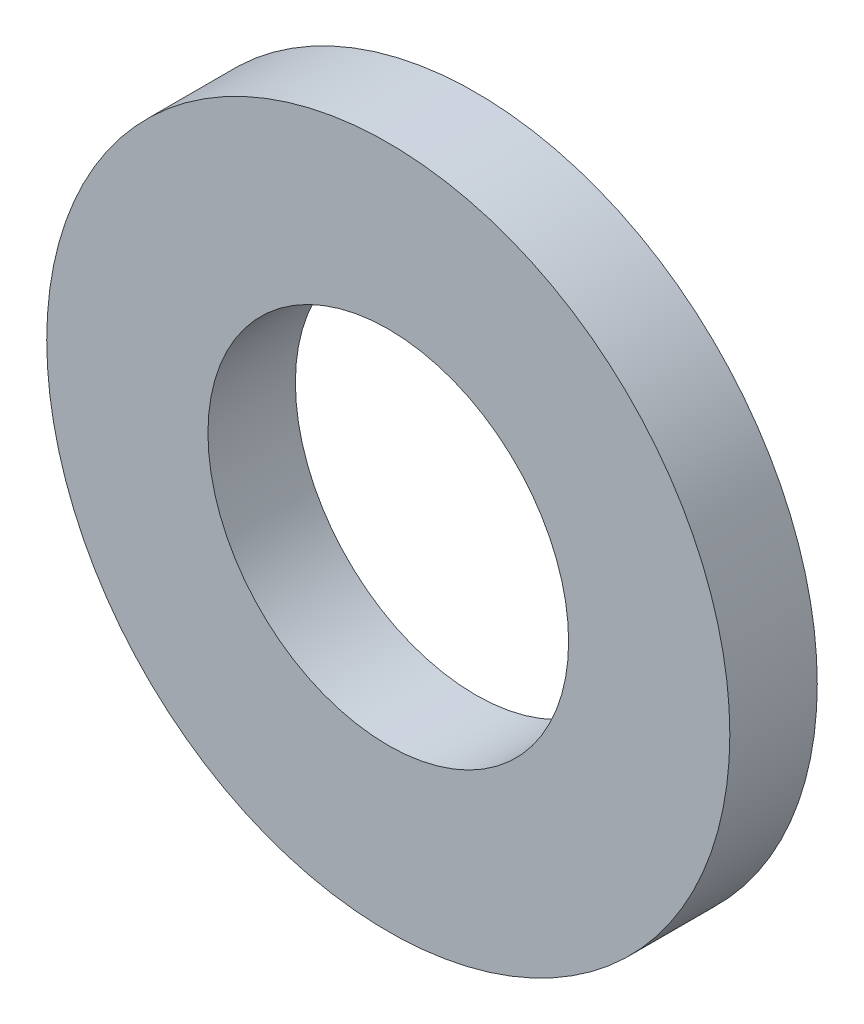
ISO-10303-21;
HEADER;
FILE_DESCRIPTION(('STEP AP214'),'2;1');
FILE_NAME('part.step','',(''),(''),'','','');
FILE_SCHEMA(('AUTOMOTIVE_DESIGN { 1 0 10303 214 1 1 1 1 }'));
ENDSEC;
DATA;
#1=APPLICATION_CONTEXT('core data for automotive mechanical design processes');
#2=APPLICATION_PROTOCOL_DEFINITION('international standard','automotive_design',2000,#1);
#3=PRODUCT_CONTEXT('',#1,'mechanical');
#4=PRODUCT('Part','Part','',(#3));
#5=PRODUCT_RELATED_PRODUCT_CATEGORY('part','',(#4));
#6=PRODUCT_DEFINITION_FORMATION('','',#4);
#7=PRODUCT_DEFINITION_CONTEXT('part definition',#1,'design');
#8=PRODUCT_DEFINITION('design','',#6,#7);
#9=PRODUCT_DEFINITION_SHAPE('','',#8);
#10=(LENGTH_UNIT() NAMED_UNIT(*) SI_UNIT(.MILLI.,.METRE.));
#11=(NAMED_UNIT(*) PLANE_ANGLE_UNIT() SI_UNIT($,.RADIAN.));
#12=(NAMED_UNIT(*) SI_UNIT($,.STERADIAN.) SOLID_ANGLE_UNIT());
#13=UNCERTAINTY_MEASURE_WITH_UNIT(LENGTH_MEASURE(1.E-05),#10,'distance_accuracy_value','');
#14=(GEOMETRIC_REPRESENTATION_CONTEXT(3) GLOBAL_UNCERTAINTY_ASSIGNED_CONTEXT((#13)) GLOBAL_UNIT_ASSIGNED_CONTEXT((#10,
#11,#12)) REPRESENTATION_CONTEXT('',''));
#15=CARTESIAN_POINT('',(0.,0.,0.));
#16=DIRECTION('',(0.,0.,1.));
#17=DIRECTION('',(1.,0.,0.));
#18=AXIS2_PLACEMENT_3D('',#15,#16,#17);
#19=CARTESIAN_POINT('',(0.,0.,0.));
#20=DIRECTION('',(0.,0.,1.));
#21=DIRECTION('',(1.,0.,0.));
#22=AXIS2_PLACEMENT_3D('',#19,#20,#21);
#23=CYLINDRICAL_SURFACE('',#22,3.3);
#24=CARTESIAN_POINT('',(0.,0.,0.));
#25=DIRECTION('',(0.,0.,1.));
#26=DIRECTION('',(1.,0.,0.));
#27=AXIS2_PLACEMENT_3D('',#24,#25,#26);
#28=CIRCLE('',#27,3.3);
#29=CARTESIAN_POINT('',(3.3,0.,0.));
#30=VERTEX_POINT('',#29);
#31=EDGE_CURVE('E10',#30,#30,#28,.T.);
#32=ORIENTED_EDGE('',*,*,#31,.T.);
#33=EDGE_LOOP('',(#32));
#34=FACE_BOUND('',#33,.T.);
#35=CARTESIAN_POINT('',(0.,0.,-1.6));
#36=DIRECTION('',(0.,0.,1.));
#37=DIRECTION('',(1.,0.,0.));
#38=AXIS2_PLACEMENT_3D('',#35,#36,#37);
#39=CIRCLE('',#38,3.3);
#40=CARTESIAN_POINT('',(3.3,0.,-1.6));
#41=VERTEX_POINT('',#40);
#42=EDGE_CURVE('E51',#41,#41,#39,.T.);
#43=ORIENTED_EDGE('',*,*,#42,.F.);
#44=EDGE_LOOP('',(#43));
#45=FACE_BOUND('',#44,.T.);
#46=ADVANCED_FACE('F40',(#34,#45),#23,.F.);
#47=CARTESIAN_POINT('',(3.3,0.,0.));
#48=DIRECTION('',(0.,0.,1.));
#49=DIRECTION('',(1.,0.,0.));
#50=AXIS2_PLACEMENT_3D('',#47,#48,#49);
#51=PLANE('',#50);
#52=CARTESIAN_POINT('',(0.,0.,0.));
#53=DIRECTION('',(0.,0.,1.));
#54=DIRECTION('',(1.,0.,0.));
#55=AXIS2_PLACEMENT_3D('',#52,#53,#54);
#56=CIRCLE('',#55,6.25);
#57=CARTESIAN_POINT('',(6.25,0.,0.));
#58=VERTEX_POINT('',#57);
#59=EDGE_CURVE('E43',#58,#58,#56,.T.);
#60=ORIENTED_EDGE('',*,*,#59,.T.);
#61=EDGE_LOOP('',(#60));
#62=FACE_BOUND('',#61,.T.);
#63=ORIENTED_EDGE('',*,*,#31,.F.);
#64=EDGE_LOOP('',(#63));
#65=FACE_BOUND('',#64,.T.);
#66=ADVANCED_FACE('F62',(#62,#65),#51,.T.);
#67=CARTESIAN_POINT('',(0.,0.,0.));
#68=DIRECTION('',(0.,0.,1.));
#69=DIRECTION('',(1.,0.,0.));
#70=AXIS2_PLACEMENT_3D('',#67,#68,#69);
#71=CYLINDRICAL_SURFACE('',#70,6.25);
#72=CARTESIAN_POINT('',(0.,0.,-1.6));
#73=DIRECTION('',(0.,0.,1.));
#74=DIRECTION('',(1.,0.,0.));
#75=AXIS2_PLACEMENT_3D('',#72,#73,#74);
#76=CIRCLE('',#75,6.25);
#77=CARTESIAN_POINT('',(6.25,0.,-1.6));
#78=VERTEX_POINT('',#77);
#79=EDGE_CURVE('E50',#78,#78,#76,.T.);
#80=ORIENTED_EDGE('',*,*,#79,.T.);
#81=EDGE_LOOP('',(#80));
#82=FACE_BOUND('',#81,.T.);
#83=ORIENTED_EDGE('',*,*,#59,.F.);
#84=EDGE_LOOP('',(#83));
#85=FACE_BOUND('',#84,.T.);
#86=ADVANCED_FACE('F63',(#82,#85),#71,.T.);
#87=CARTESIAN_POINT('',(3.3,0.,-1.6));
#88=DIRECTION('',(0.,0.,-1.));
#89=DIRECTION('',(-1.,0.,0.));
#90=AXIS2_PLACEMENT_3D('',#87,#88,#89);
#91=PLANE('',#90);
#92=ORIENTED_EDGE('',*,*,#42,.T.);
#93=EDGE_LOOP('',(#92));
#94=FACE_BOUND('',#93,.T.);
#95=ORIENTED_EDGE('',*,*,#79,.F.);
#96=EDGE_LOOP('',(#95));
#97=FACE_BOUND('',#96,.T.);
#98=ADVANCED_FACE('F60',(#94,#97),#91,.T.);
#99=CLOSED_SHELL('',(#46,#66,#86,#98));
#100=MANIFOLD_SOLID_BREP('B2',#99);
#101=ADVANCED_BREP_SHAPE_REPRESENTATION('',(#18,#100),#14);
#102=SHAPE_DEFINITION_REPRESENTATION(#9,#101);
ENDSEC;
END-ISO-10303-21;
